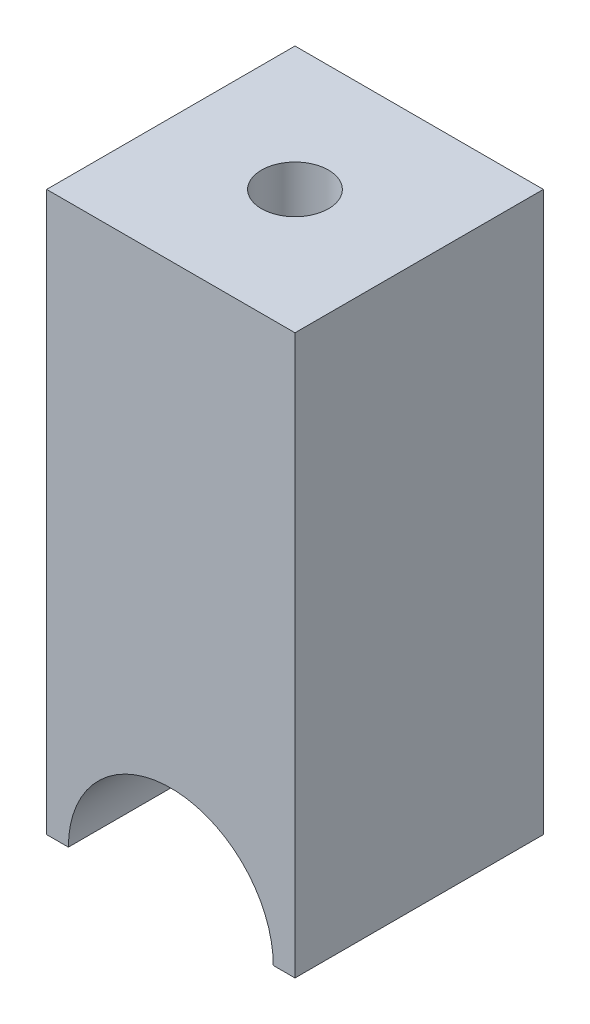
ISO-10303-21;
HEADER;
FILE_DESCRIPTION(('STEP AP214'),'2;1');
FILE_NAME('part.step','',(''),(''),'','','');
FILE_SCHEMA(('AUTOMOTIVE_DESIGN { 1 0 10303 214 1 1 1 1 }'));
ENDSEC;
DATA;
#1=APPLICATION_CONTEXT('core data for automotive mechanical design processes');
#2=APPLICATION_PROTOCOL_DEFINITION('international standard','automotive_design',2000,#1);
#3=PRODUCT_CONTEXT('',#1,'mechanical');
#4=PRODUCT('Part','Part','',(#3));
#5=PRODUCT_RELATED_PRODUCT_CATEGORY('part','',(#4));
#6=PRODUCT_DEFINITION_FORMATION('','',#4);
#7=PRODUCT_DEFINITION_CONTEXT('part definition',#1,'design');
#8=PRODUCT_DEFINITION('design','',#6,#7);
#9=PRODUCT_DEFINITION_SHAPE('','',#8);
#10=(LENGTH_UNIT() NAMED_UNIT(*) SI_UNIT(.MILLI.,.METRE.));
#11=(NAMED_UNIT(*) PLANE_ANGLE_UNIT() SI_UNIT($,.RADIAN.));
#12=(NAMED_UNIT(*) SI_UNIT($,.STERADIAN.) SOLID_ANGLE_UNIT());
#13=UNCERTAINTY_MEASURE_WITH_UNIT(LENGTH_MEASURE(1.E-05),#10,'distance_accuracy_value','');
#14=(GEOMETRIC_REPRESENTATION_CONTEXT(3) GLOBAL_UNCERTAINTY_ASSIGNED_CONTEXT((#13)) GLOBAL_UNIT_ASSIGNED_CONTEXT((#10,
#11,#12)) REPRESENTATION_CONTEXT('',''));
#15=CARTESIAN_POINT('',(0.,0.,0.));
#16=DIRECTION('',(0.,0.,1.));
#17=DIRECTION('',(1.,0.,0.));
#18=AXIS2_PLACEMENT_3D('',#15,#16,#17);
#19=CARTESIAN_POINT('',(-12.7,0.,12.7));
#20=DIRECTION('',(0.,1.,0.));
#21=DIRECTION('',(0.,0.,1.));
#22=AXIS2_PLACEMENT_3D('',#19,#20,#21);
#23=PLANE('',#22);
#24=DIRECTION('',(-1.,0.,0.));
#25=VECTOR('',#24,1.);
#26=CARTESIAN_POINT('',(-12.7,0.,-12.7));
#27=LINE('',#26,#25);
#28=CARTESIAN_POINT('',(-10.4775,0.,-12.7));
#29=VERTEX_POINT('',#28);
#30=CARTESIAN_POINT('',(-12.7,0.,-12.7));
#31=VERTEX_POINT('',#30);
#32=EDGE_CURVE('E120',#29,#31,#27,.T.);
#33=ORIENTED_EDGE('',*,*,#32,.F.);
#34=DIRECTION('',(0.,0.,1.));
#35=VECTOR('',#34,1.);
#36=CARTESIAN_POINT('',(-10.4775,0.,-12.7));
#37=LINE('',#36,#35);
#38=CARTESIAN_POINT('',(-10.4775,0.,12.7));
#39=VERTEX_POINT('',#38);
#40=EDGE_CURVE('E11',#29,#39,#37,.T.);
#41=ORIENTED_EDGE('',*,*,#40,.T.);
#42=DIRECTION('',(1.,0.,0.));
#43=VECTOR('',#42,1.);
#44=CARTESIAN_POINT('',(-12.7,0.,12.7));
#45=LINE('',#44,#43);
#46=CARTESIAN_POINT('',(-12.7,0.,12.7));
#47=VERTEX_POINT('',#46);
#48=EDGE_CURVE('E108',#47,#39,#45,.T.);
#49=ORIENTED_EDGE('',*,*,#48,.F.);
#50=DIRECTION('',(0.,0.,1.));
#51=VECTOR('',#50,1.);
#52=CARTESIAN_POINT('',(-12.7,0.,-12.7));
#53=LINE('',#52,#51);
#54=EDGE_CURVE('E113',#31,#47,#53,.T.);
#55=ORIENTED_EDGE('',*,*,#54,.F.);
#56=EDGE_LOOP('',(#33,#41,#49,#55));
#57=FACE_BOUND('',#56,.T.);
#58=ADVANCED_FACE('F36',(#57),#23,.F.);
#59=CARTESIAN_POINT('',(-12.7,57.15,-12.7));
#60=DIRECTION('',(1.,0.,0.));
#61=DIRECTION('',(0.,0.,-1.));
#62=AXIS2_PLACEMENT_3D('',#59,#60,#61);
#63=PLANE('',#62);
#64=ORIENTED_EDGE('',*,*,#54,.T.);
#65=DIRECTION('',(0.,-1.,0.));
#66=VECTOR('',#65,1.);
#67=CARTESIAN_POINT('',(-12.7,57.15,12.7));
#68=LINE('',#67,#66);
#69=CARTESIAN_POINT('',(-12.7,57.15,12.7));
#70=VERTEX_POINT('',#69);
#71=EDGE_CURVE('E99',#70,#47,#68,.T.);
#72=ORIENTED_EDGE('',*,*,#71,.F.);
#73=DIRECTION('',(0.,0.,1.));
#74=VECTOR('',#73,1.);
#75=CARTESIAN_POINT('',(-12.7,57.15,-12.7));
#76=LINE('',#75,#74);
#77=CARTESIAN_POINT('',(-12.7,57.15,-12.7));
#78=VERTEX_POINT('',#77);
#79=EDGE_CURVE('E123',#78,#70,#76,.T.);
#80=ORIENTED_EDGE('',*,*,#79,.F.);
#81=DIRECTION('',(0.,-1.,0.));
#82=VECTOR('',#81,1.);
#83=CARTESIAN_POINT('',(-12.7,57.15,-12.7));
#84=LINE('',#83,#82);
#85=EDGE_CURVE('E130',#78,#31,#84,.T.);
#86=ORIENTED_EDGE('',*,*,#85,.T.);
#87=EDGE_LOOP('',(#64,#72,#80,#86));
#88=FACE_BOUND('',#87,.T.);
#89=ADVANCED_FACE('F38',(#88),#63,.F.);
#90=CARTESIAN_POINT('',(-12.7,57.15,12.7));
#91=DIRECTION('',(0.,0.,-1.));
#92=DIRECTION('',(-1.,0.,0.));
#93=AXIS2_PLACEMENT_3D('',#90,#91,#92);
#94=PLANE('',#93);
#95=ORIENTED_EDGE('',*,*,#48,.T.);
#96=CARTESIAN_POINT('',(0.,0.,12.7));
#97=DIRECTION('',(0.,0.,1.));
#98=DIRECTION('',(1.,0.,0.));
#99=AXIS2_PLACEMENT_3D('',#96,#97,#98);
#100=CIRCLE('',#99,10.4775);
#101=CARTESIAN_POINT('',(10.4775,0.,12.7));
#102=VERTEX_POINT('',#101);
#103=EDGE_CURVE('E94',#102,#39,#100,.T.);
#104=ORIENTED_EDGE('',*,*,#103,.F.);
#105=CARTESIAN_POINT('',(12.7,0.,12.7));
#106=VERTEX_POINT('',#105);
#107=EDGE_CURVE('E105',#102,#106,#45,.T.);
#108=ORIENTED_EDGE('',*,*,#107,.T.);
#109=DIRECTION('',(0.,-1.,0.));
#110=VECTOR('',#109,1.);
#111=CARTESIAN_POINT('',(12.7,57.15,12.7));
#112=LINE('',#111,#110);
#113=CARTESIAN_POINT('',(12.7,57.15,12.7));
#114=VERTEX_POINT('',#113);
#115=EDGE_CURVE('E136',#114,#106,#112,.T.);
#116=ORIENTED_EDGE('',*,*,#115,.F.);
#117=DIRECTION('',(1.,0.,0.));
#118=VECTOR('',#117,1.);
#119=CARTESIAN_POINT('',(-12.7,57.15,12.7));
#120=LINE('',#119,#118);
#121=EDGE_CURVE('E125',#70,#114,#120,.T.);
#122=ORIENTED_EDGE('',*,*,#121,.F.);
#123=ORIENTED_EDGE('',*,*,#71,.T.);
#124=EDGE_LOOP('',(#95,#104,#108,#116,#122,#123));
#125=FACE_BOUND('',#124,.T.);
#126=ADVANCED_FACE('F103',(#125),#94,.F.);
#127=CARTESIAN_POINT('',(12.7,57.15,-12.7));
#128=DIRECTION('',(-1.,0.,0.));
#129=DIRECTION('',(0.,0.,1.));
#130=AXIS2_PLACEMENT_3D('',#127,#128,#129);
#131=PLANE('',#130);
#132=DIRECTION('',(0.,0.,-1.));
#133=VECTOR('',#132,1.);
#134=CARTESIAN_POINT('',(12.7,0.,-12.7));
#135=LINE('',#134,#133);
#136=CARTESIAN_POINT('',(12.7,0.,-12.7));
#137=VERTEX_POINT('',#136);
#138=EDGE_CURVE('E112',#106,#137,#135,.T.);
#139=ORIENTED_EDGE('',*,*,#138,.T.);
#140=DIRECTION('',(0.,-1.,0.));
#141=VECTOR('',#140,1.);
#142=CARTESIAN_POINT('',(12.7,57.15,-12.7));
#143=LINE('',#142,#141);
#144=CARTESIAN_POINT('',(12.7,57.15,-12.7));
#145=VERTEX_POINT('',#144);
#146=EDGE_CURVE('E133',#145,#137,#143,.T.);
#147=ORIENTED_EDGE('',*,*,#146,.F.);
#148=DIRECTION('',(0.,0.,-1.));
#149=VECTOR('',#148,1.);
#150=CARTESIAN_POINT('',(12.7,57.15,-12.7));
#151=LINE('',#150,#149);
#152=EDGE_CURVE('E127',#114,#145,#151,.T.);
#153=ORIENTED_EDGE('',*,*,#152,.F.);
#154=ORIENTED_EDGE('',*,*,#115,.T.);
#155=EDGE_LOOP('',(#139,#147,#153,#154));
#156=FACE_BOUND('',#155,.T.);
#157=ADVANCED_FACE('F176',(#156),#131,.F.);
#158=CARTESIAN_POINT('',(-12.7,57.15,-12.7));
#159=DIRECTION('',(0.,0.,1.));
#160=DIRECTION('',(1.,0.,0.));
#161=AXIS2_PLACEMENT_3D('',#158,#159,#160);
#162=PLANE('',#161);
#163=CARTESIAN_POINT('',(10.4775,0.,-12.7));
#164=VERTEX_POINT('',#163);
#165=EDGE_CURVE('E121',#137,#164,#27,.T.);
#166=ORIENTED_EDGE('',*,*,#165,.T.);
#167=CARTESIAN_POINT('',(0.,0.,-12.7));
#168=DIRECTION('',(0.,0.,1.));
#169=DIRECTION('',(1.,0.,0.));
#170=AXIS2_PLACEMENT_3D('',#167,#168,#169);
#171=CIRCLE('',#170,10.4775);
#172=EDGE_CURVE('E56',#164,#29,#171,.T.);
#173=ORIENTED_EDGE('',*,*,#172,.T.);
#174=ORIENTED_EDGE('',*,*,#32,.T.);
#175=ORIENTED_EDGE('',*,*,#85,.F.);
#176=DIRECTION('',(-1.,0.,0.));
#177=VECTOR('',#176,1.);
#178=CARTESIAN_POINT('',(-12.7,57.15,-12.7));
#179=LINE('',#178,#177);
#180=EDGE_CURVE('E64',#145,#78,#179,.T.);
#181=ORIENTED_EDGE('',*,*,#180,.F.);
#182=ORIENTED_EDGE('',*,*,#146,.T.);
#183=EDGE_LOOP('',(#166,#173,#174,#175,#181,#182));
#184=FACE_BOUND('',#183,.T.);
#185=ADVANCED_FACE('F145',(#184),#162,.F.);
#186=CARTESIAN_POINT('',(-12.7,57.15,12.7));
#187=DIRECTION('',(0.,1.,0.));
#188=DIRECTION('',(0.,0.,1.));
#189=AXIS2_PLACEMENT_3D('',#186,#187,#188);
#190=PLANE('',#189);
#191=CARTESIAN_POINT('',(0.,57.15,0.));
#192=DIRECTION('',(0.,1.,0.));
#193=DIRECTION('',(0.,0.,1.));
#194=AXIS2_PLACEMENT_3D('',#191,#192,#193);
#195=CIRCLE('',#194,3.429);
#196=CARTESIAN_POINT('',(0.,57.15,3.429));
#197=VERTEX_POINT('',#196);
#198=EDGE_CURVE('E147',#197,#197,#195,.T.);
#199=ORIENTED_EDGE('',*,*,#198,.F.);
#200=EDGE_LOOP('',(#199));
#201=FACE_BOUND('',#200,.T.);
#202=ORIENTED_EDGE('',*,*,#79,.T.);
#203=ORIENTED_EDGE('',*,*,#121,.T.);
#204=ORIENTED_EDGE('',*,*,#152,.T.);
#205=ORIENTED_EDGE('',*,*,#180,.T.);
#206=EDGE_LOOP('',(#202,#203,#204,#205));
#207=FACE_BOUND('',#206,.T.);
#208=ADVANCED_FACE('F168',(#201,#207),#190,.T.);
#209=ORIENTED_EDGE('',*,*,#107,.F.);
#210=DIRECTION('',(0.,0.,1.));
#211=VECTOR('',#210,1.);
#212=CARTESIAN_POINT('',(10.4775,0.,-12.7));
#213=LINE('',#212,#211);
#214=EDGE_CURVE('E49',#102,#164,#213,.F.);
#215=ORIENTED_EDGE('',*,*,#214,.T.);
#216=ORIENTED_EDGE('',*,*,#165,.F.);
#217=ORIENTED_EDGE('',*,*,#138,.F.);
#218=EDGE_LOOP('',(#209,#215,#216,#217));
#219=FACE_BOUND('',#218,.T.);
#220=ADVANCED_FACE('F111',(#219),#23,.F.);
#221=CARTESIAN_POINT('',(0.,0.,-12.7));
#222=DIRECTION('',(0.,0.,1.));
#223=DIRECTION('',(1.,0.,0.));
#224=AXIS2_PLACEMENT_3D('',#221,#222,#223);
#225=CYLINDRICAL_SURFACE('',#224,10.4775);
#226=CARTESIAN_POINT('',(0.,10.4775,3.429));
#227=CARTESIAN_POINT('',(0.18728898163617,10.4775000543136,3.42900021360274));
#228=CARTESIAN_POINT('',(0.374578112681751,10.4724315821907,3.41360554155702));
#229=CARTESIAN_POINT('',(0.743651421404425,10.4527108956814,3.35261398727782));
#230=CARTESIAN_POINT('',(0.925434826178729,10.4380573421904,3.30701288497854));
#231=CARTESIAN_POINT('',(1.27812224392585,10.4007612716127,3.18733083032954));
#232=CARTESIAN_POINT('',(1.44904351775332,10.3781318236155,3.11329645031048));
#233=CARTESIAN_POINT('',(1.77604419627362,10.3272016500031,2.93905625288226));
#234=CARTESIAN_POINT('',(1.93212083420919,10.2988998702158,2.83884556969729));
#235=CARTESIAN_POINT('',(2.23023513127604,10.2385498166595,2.61156615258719));
#236=CARTESIAN_POINT('',(2.3717059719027,10.2064141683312,2.48377726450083));
#237=CARTESIAN_POINT('',(2.63163861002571,10.1425063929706,2.2065006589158));
#238=CARTESIAN_POINT('',(2.75009558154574,10.1107343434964,2.05700840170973));
#239=CARTESIAN_POINT('',(2.9638250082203,10.0501968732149,1.73552401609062));
#240=CARTESIAN_POINT('',(3.05836919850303,10.0215383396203,1.563025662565));
#241=CARTESIAN_POINT('',(3.21686528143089,9.97179698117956,1.20348770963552));
#242=CARTESIAN_POINT('',(3.28082612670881,9.95071193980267,1.01645238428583));
#243=CARTESIAN_POINT('',(3.37422900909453,9.9194231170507,0.639581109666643));
#244=CARTESIAN_POINT('',(3.40473005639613,9.90888649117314,0.450036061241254));
#245=CARTESIAN_POINT('',(3.43365755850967,9.89890187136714,0.0682484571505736));
#246=CARTESIAN_POINT('',(3.43209350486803,9.89945059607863,-0.123993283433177));
#247=CARTESIAN_POINT('',(3.39775923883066,9.9112823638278,-0.496767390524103));
#248=CARTESIAN_POINT('',(3.3663602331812,9.92209371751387,-0.677443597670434));
#249=CARTESIAN_POINT('',(3.27548020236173,9.95246239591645,-1.03080686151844));
#250=CARTESIAN_POINT('',(3.21599592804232,9.97202073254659,-1.20349299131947));
#251=CARTESIAN_POINT('',(3.06971552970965,10.0180232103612,-1.539134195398));
#252=CARTESIAN_POINT('',(2.98250596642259,10.0445704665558,-1.70189434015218));
#253=CARTESIAN_POINT('',(2.78353757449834,10.1015151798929,-2.01090863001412));
#254=CARTESIAN_POINT('',(2.67177186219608,10.1319137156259,-2.1571581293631));
#255=CARTESIAN_POINT('',(2.42023574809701,10.1950024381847,-2.43671892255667));
#256=CARTESIAN_POINT('',(2.27934102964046,10.2277310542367,-2.56901194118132));
#257=CARTESIAN_POINT('',(1.97696167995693,10.2904538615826,-2.8083527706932));
#258=CARTESIAN_POINT('',(1.81547521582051,10.3204478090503,-2.91539833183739));
#259=CARTESIAN_POINT('',(1.4743954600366,10.3746911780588,-3.10198630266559));
#260=CARTESIAN_POINT('',(1.29464832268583,10.3988848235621,-3.18126480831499));
#261=CARTESIAN_POINT('',(0.923389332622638,10.4383974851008,-3.30814756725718));
#262=CARTESIAN_POINT('',(0.73188143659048,10.4537194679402,-3.35576241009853));
#263=CARTESIAN_POINT('',(0.351164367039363,10.4732751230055,-3.41618290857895));
#264=CARTESIAN_POINT('',(0.162195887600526,10.4779470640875,-3.43036526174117));
#265=CARTESIAN_POINT('',(-0.215452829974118,10.476985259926,-3.42742794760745));
#266=CARTESIAN_POINT('',(-0.404133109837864,10.4713531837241,-3.41031334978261));
#267=CARTESIAN_POINT('',(-0.770398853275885,10.4507051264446,-3.34636223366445));
#268=CARTESIAN_POINT('',(-0.948146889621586,10.4359536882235,-3.30036305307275));
#269=CARTESIAN_POINT('',(-1.29333778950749,10.3988194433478,-3.18098792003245));
#270=CARTESIAN_POINT('',(-1.46077934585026,10.3764356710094,-3.10760850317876));
#271=CARTESIAN_POINT('',(-1.78541013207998,10.3256004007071,-2.9334543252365));
#272=CARTESIAN_POINT('',(-1.94222403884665,10.2970074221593,-2.83202241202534));
#273=CARTESIAN_POINT('',(-2.23705719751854,10.2370042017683,-2.6054192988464));
#274=CARTESIAN_POINT('',(-2.3750708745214,10.2055931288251,-2.48024108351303));
#275=CARTESIAN_POINT('',(-2.63465923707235,10.1417571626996,-2.20322272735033));
#276=CARTESIAN_POINT('',(-2.75525171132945,10.1093479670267,-2.05045636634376));
#277=CARTESIAN_POINT('',(-2.96920098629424,10.0485950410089,-1.72615657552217));
#278=CARTESIAN_POINT('',(-3.0625577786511,10.0202513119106,-1.55462313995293));
#279=CARTESIAN_POINT('',(-3.21890318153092,9.97112865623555,-1.1977235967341));
#280=CARTESIAN_POINT('',(-3.28197183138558,9.95032982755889,-1.01239545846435));
#281=CARTESIAN_POINT('',(-3.37573893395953,9.91891556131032,-0.632916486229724));
#282=CARTESIAN_POINT('',(-3.40645128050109,9.90829575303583,-0.438769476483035));
#283=CARTESIAN_POINT('',(-3.43357505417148,9.89892683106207,-0.0575133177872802));
#284=CARTESIAN_POINT('',(-3.43161098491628,9.89961549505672,0.129467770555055));
#285=CARTESIAN_POINT('',(-3.39741307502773,9.9114030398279,0.500289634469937));
#286=CARTESIAN_POINT('',(-3.36518091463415,9.92250134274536,0.684130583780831));
#287=CARTESIAN_POINT('',(-3.27249375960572,9.9534464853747,1.04023855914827));
#288=CARTESIAN_POINT('',(-3.21254659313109,9.97313556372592,1.21265253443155));
#289=CARTESIAN_POINT('',(-3.06653878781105,10.0189906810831,1.54510938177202));
#290=CARTESIAN_POINT('',(-2.98047248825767,10.0451581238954,1.70514956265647));
#291=CARTESIAN_POINT('',(-2.78041616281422,10.102402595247,2.01565472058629));
#292=CARTESIAN_POINT('',(-2.66539848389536,10.1336405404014,2.16542777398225));
#293=CARTESIAN_POINT('',(-2.41246255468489,10.1968132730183,2.44407233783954));
#294=CARTESIAN_POINT('',(-2.27453793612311,10.2287482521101,2.57293801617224));
#295=CARTESIAN_POINT('',(-1.97356287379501,10.2911370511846,2.81091294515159));
#296=CARTESIAN_POINT('',(-1.80977081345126,10.3214921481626,2.91911325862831));
#297=CARTESIAN_POINT('',(-1.4653378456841,10.3759880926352,3.10631845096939));
#298=CARTESIAN_POINT('',(-1.28470196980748,10.4001307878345,3.18533201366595));
#299=CARTESIAN_POINT('',(-0.922235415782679,10.4383328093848,3.30787328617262));
#300=CARTESIAN_POINT('',(-0.74104979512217,10.4528850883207,3.35315484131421));
#301=CARTESIAN_POINT('',(-0.373241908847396,10.4724674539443,3.41371430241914));
#302=CARTESIAN_POINT('',(-0.186621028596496,10.4774999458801,3.42899978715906));
#303=CARTESIAN_POINT('',(0.,10.4775,3.429));
#304=B_SPLINE_CURVE_WITH_KNOTS('',3,(#226,#227,#228,#229,#230,#231,#232,#233,#234,#235,#236,
#237,#238,#239,#240,#241,#242,#243,#244,#245,#246,#247,#248,#249,#250,#251,#252,#253,#254,#255,
#256,#257,#258,#259,#260,#261,#262,#263,#264,#265,#266,#267,#268,#269,#270,#271,#272,#273,#274,
#275,#276,#277,#278,#279,#280,#281,#282,#283,#284,#285,#286,#287,#288,#289,#290,#291,#292,#293,
#294,#295,#296,#297,#298,#299,#300,#301,#302,#303),.UNSPECIFIED.,.T.,.F.,(4,2,2,2,2,2,2,2,2,2,2,
2,2,2,2,2,2,2,2,2,2,2,2,2,2,2,2,2,2,2,2,2,2,2,2,2,2,2,4),(0.,0.561180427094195,1.12243927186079,
1.68278269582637,2.24323035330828,2.82061530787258,3.39812120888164,3.99153005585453,
4.58476508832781,5.15862797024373,5.7323209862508,6.2808610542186,6.82946459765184,
7.38666624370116,7.94402428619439,8.52936619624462,9.11476024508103,9.70557595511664,
10.296193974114,10.8620308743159,11.4277761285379,11.9778334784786,12.5279604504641,
13.0922619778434,13.6567304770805,14.2458714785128,14.8350126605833,15.4225882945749,
16.0099115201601,16.5681272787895,17.1263120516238,17.674651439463,18.2231097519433,
18.7947805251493,19.366610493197,19.9596280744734,20.5524690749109,21.111789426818,
21.6709684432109),.UNSPECIFIED.);
#305=CARTESIAN_POINT('',(0.,10.4775,3.429));
#306=VERTEX_POINT('',#305);
#307=EDGE_CURVE('E40',#306,#306,#304,.T.);
#308=ORIENTED_EDGE('',*,*,#307,.T.);
#309=EDGE_LOOP('',(#308));
#310=FACE_BOUND('',#309,.T.);
#311=ORIENTED_EDGE('',*,*,#172,.F.);
#312=ORIENTED_EDGE('',*,*,#214,.F.);
#313=ORIENTED_EDGE('',*,*,#103,.T.);
#314=ORIENTED_EDGE('',*,*,#40,.F.);
#315=EDGE_LOOP('',(#311,#312,#313,#314));
#316=FACE_BOUND('',#315,.T.);
#317=ADVANCED_FACE('F93',(#310,#316),#225,.F.);
#318=CARTESIAN_POINT('',(0.,0.,0.));
#319=DIRECTION('',(0.,1.,0.));
#320=DIRECTION('',(0.,0.,1.));
#321=AXIS2_PLACEMENT_3D('',#318,#319,#320);
#322=CYLINDRICAL_SURFACE('',#321,3.429);
#323=ORIENTED_EDGE('',*,*,#198,.T.);
#324=EDGE_LOOP('',(#323));
#325=FACE_BOUND('',#324,.T.);
#326=ORIENTED_EDGE('',*,*,#307,.F.);
#327=EDGE_LOOP('',(#326));
#328=FACE_BOUND('',#327,.T.);
#329=ADVANCED_FACE('F155',(#325,#328),#322,.F.);
#330=CLOSED_SHELL('',(#58,#89,#126,#157,#185,#208,#220,#317,#329));
#331=MANIFOLD_SOLID_BREP('B2',#330);
#332=ADVANCED_BREP_SHAPE_REPRESENTATION('',(#18,#331),#14);
#333=SHAPE_DEFINITION_REPRESENTATION(#9,#332);
ENDSEC;
END-ISO-10303-21;
